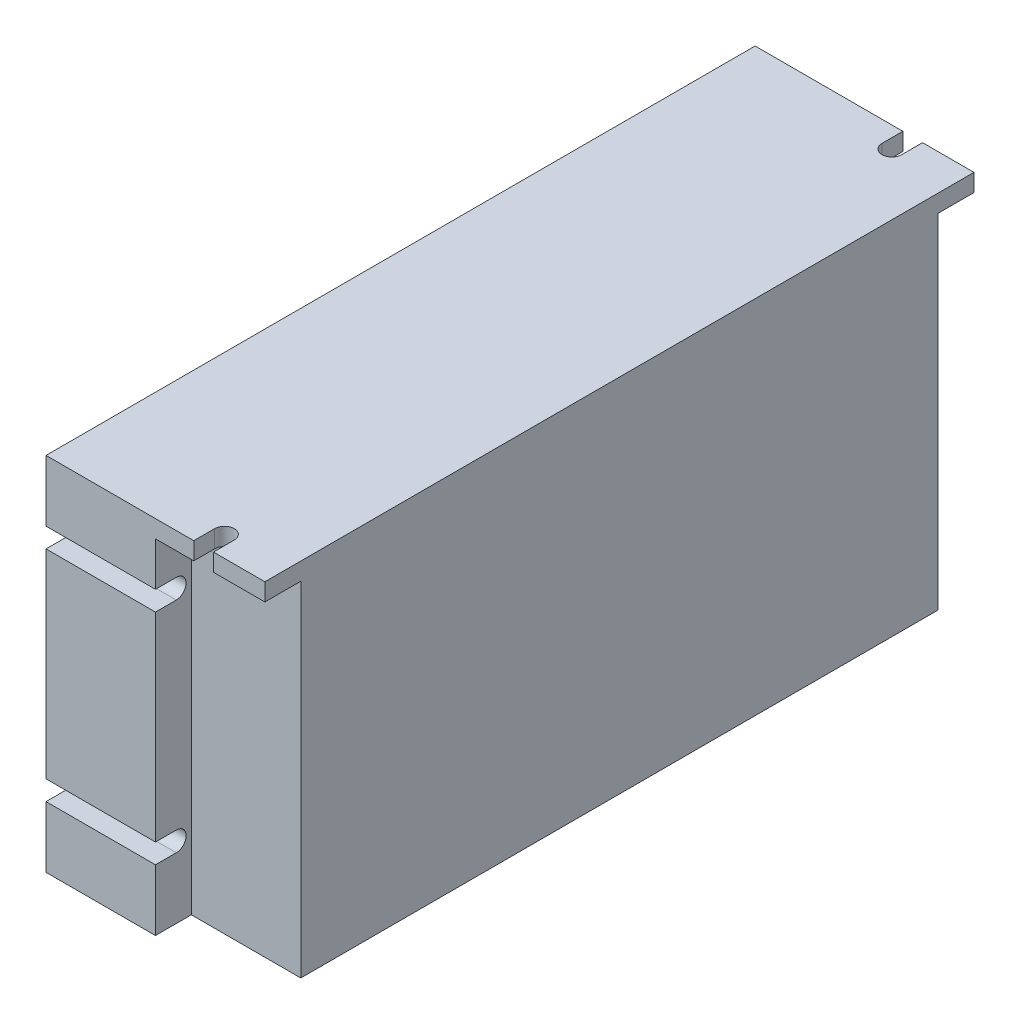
from build123d import *

# Parameters (mm, degrees)
SKETCH_1_W          = 162
SKETCH_1_H          = 82.5
EXTRUDE_1_DEPTH     = 50
SKETCH_2_W          = 8.2
SKETCH_2_H          = 78.5
CUT_EXTRUDE_1_DEPTH = 25
CUT_EXTRUDE_2_DEPTH = 25
CUT_EXTRUDE_3_DEPTH = 4


with BuildPart() as part:
    # Sketch 1 → Extrude 1 (new body)
    with BuildSketch(Plane(origin=(0, 0, 0), x_dir=(0, 0, -1), z_dir=(1, 0, 0))):
        Rectangle(SKETCH_1_W, SKETCH_1_H)
    extrude(amount=EXTRUDE_1_DEPTH)

    # Sketch 2 → Cut-Extrude 1 (cut)
    with BuildSketch(Plane(origin=(50, 0, 0), x_dir=(0, 0, -1), z_dir=(1, 0, 0))):
        with Locations((-76.9, -2)):
            Rectangle(SKETCH_2_W, SKETCH_2_H)
        with Locations((76.9, -2)):
            Rectangle(SKETCH_2_W, SKETCH_2_H)
    extrude(amount=-CUT_EXTRUDE_1_DEPTH, mode=Mode.SUBTRACT)

    # Sketch 3 → Cut-Extrude 2 (cut)
    with BuildSketch(Plane(origin=(25, 0, 0), x_dir=(0, 0, -1), z_dir=(1, 0, 0))):
        with BuildLine():
            Line((-76.25, -27.25), (-81, -27.25))
            Line((-81, -27.25), (-81, -22.75))
            Line((-81, -22.75), (-76.25, -22.75))
            ThreePointArc((-76.25, -22.75), (-74, -25), (-76.25, -27.25))
        make_face()
        with BuildLine():
            Line((-76.25, 22.75), (-81, 22.75))
            Line((-81, 22.75), (-81, 27.25))
            Line((-81, 27.25), (-76.25, 27.25))
            ThreePointArc((-76.25, 27.25), (-74, 25), (-76.25, 22.75))
        make_face()
        with BuildLine():
            Line((76.25, -22.75), (81, -22.75))
            Line((81, -22.75), (81, -27.25))
            Line((81, -27.25), (76.25, -27.25))
            ThreePointArc((76.25, -27.25), (74, -25), (76.25, -22.75))
        make_face()
        with BuildLine():
            Line((76.25, 27.25), (81, 27.25))
            Line((81, 27.25), (81, 22.75))
            Line((81, 22.75), (76.25, 22.75))
            ThreePointArc((76.25, 22.75), (74, 25), (76.25, 27.25))
        make_face()
    extrude(amount=-CUT_EXTRUDE_2_DEPTH, mode=Mode.SUBTRACT)

    # Sketch 4 → Cut-Extrude 3 (cut)
    with BuildSketch(Plane(origin=(0, 41.25, 0), x_dir=(1, 0, 0), z_dir=(0, 1, 0))):
        with BuildLine():
            Line((33.75, 76.25), (33.75, 81))
            Line((33.75, 81), (38.25, 81))
            Line((38.25, 81), (38.25, 76.25))
            ThreePointArc((38.25, 76.25), (36, 74), (33.75, 76.25))
        make_face()
        with BuildLine():
            Line((33.75, -76.25), (33.75, -81))
            Line((33.75, -81), (38.25, -81))
            Line((38.25, -81), (38.25, -76.25))
            ThreePointArc((38.25, -76.25), (36, -74), (33.75, -76.25))
        make_face()
    extrude(amount=-CUT_EXTRUDE_3_DEPTH, mode=Mode.SUBTRACT)


solid = part.part
